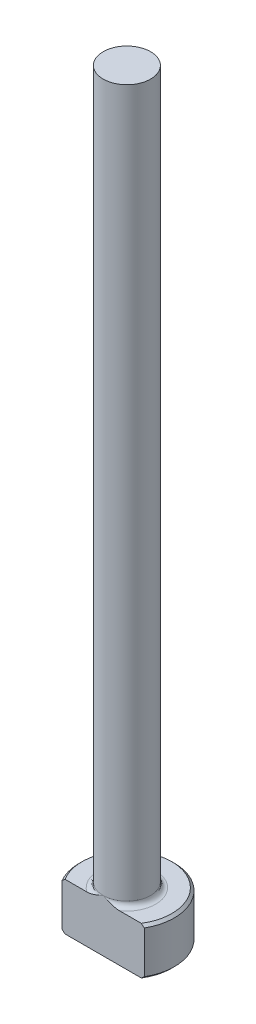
from build123d import *

# Parameters (mm, degrees)
CHAMFER1_SIZE = 0.254
FILLET1_R     = 0.508
KEY_DEPTH     = 77.49707715


with BuildPart() as part:
    # Sketch1 → Revolve1 (revolve)
    with BuildSketch(Plane.XY, mode=Mode.PRIVATE) as revolve1_sk:
        Polygon((0, 0), (-4.7625, 0), (-4.7625, 4.7498), (-2.38125, 4.7498), (-2.38125, 76.2), (0, 76.2), align=None)
    revolve(revolve1_sk.sketch.rotate(Axis((0, 259.958771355, 0), (0, -1, 0)), 270), axis=Axis((0, 259.958771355, 0), (0, -1, 0)))

    # Chamfer1
    chamfer1_edges = [part.edges().sort_by_distance(p)[0] for p in [
        (0, 4.7498, -4.7625),
        (0, 0, -4.7625),
    ]]
    chamfer(chamfer1_edges, length=CHAMFER1_SIZE)

    # Fillet1
    fillet1_edges = [part.edges().sort_by_distance(p)[0] for p in [
        (0, 4.7498, -2.38125),
    ]]
    fillet(fillet1_edges, radius=FILLET1_R)

    # Sketch2 → KEY (cut, through all)
    with BuildSketch(Plane.XZ):
        with BuildLine():
            Line((-4.124445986, 2.38125), (4.124445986, 2.38125))
            ThreePointArc((4.124445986, 2.38125), (0, 4.7625), (-4.124445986, 2.38125))
        make_face()
    extrude(amount=-KEY_DEPTH, mode=Mode.SUBTRACT)


solid = part.part
